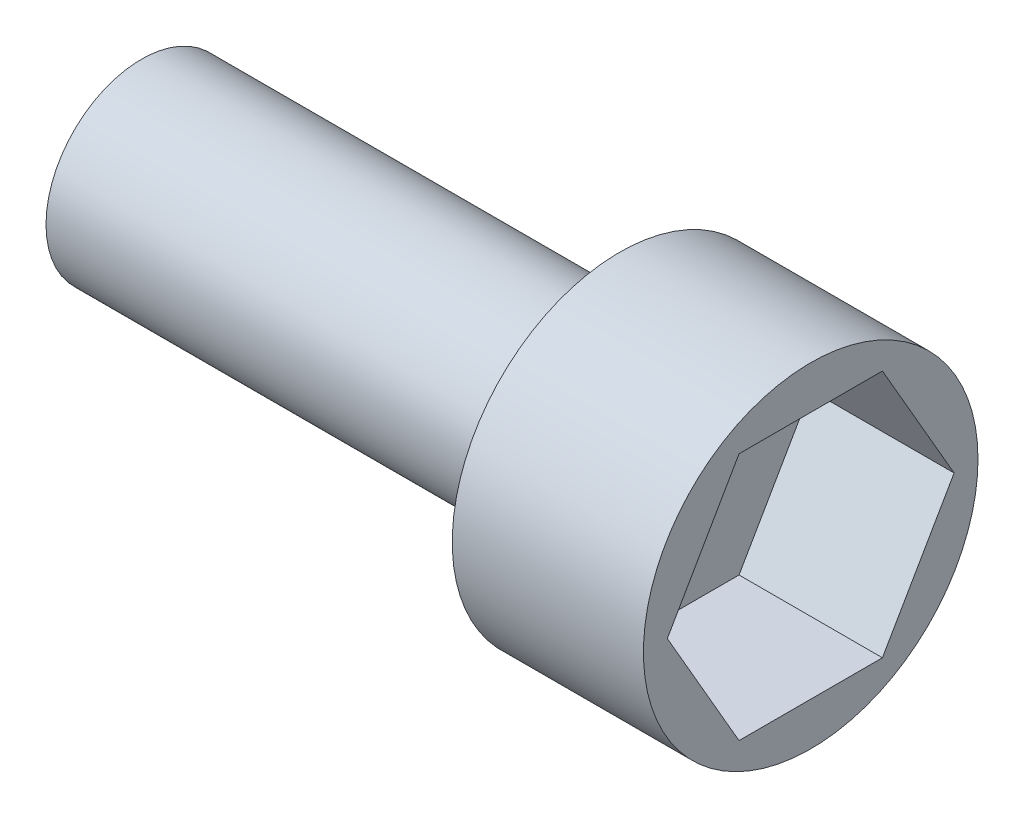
ISO-10303-21;
HEADER;
FILE_DESCRIPTION(('STEP AP214'),'2;1');
FILE_NAME('part.step','',(''),(''),'','','');
FILE_SCHEMA(('AUTOMOTIVE_DESIGN { 1 0 10303 214 1 1 1 1 }'));
ENDSEC;
DATA;
#1=APPLICATION_CONTEXT('core data for automotive mechanical design processes');
#2=APPLICATION_PROTOCOL_DEFINITION('international standard','automotive_design',2000,#1);
#3=PRODUCT_CONTEXT('',#1,'mechanical');
#4=PRODUCT('Part','Part','',(#3));
#5=PRODUCT_RELATED_PRODUCT_CATEGORY('part','',(#4));
#6=PRODUCT_DEFINITION_FORMATION('','',#4);
#7=PRODUCT_DEFINITION_CONTEXT('part definition',#1,'design');
#8=PRODUCT_DEFINITION('design','',#6,#7);
#9=PRODUCT_DEFINITION_SHAPE('','',#8);
#10=(LENGTH_UNIT() NAMED_UNIT(*) SI_UNIT(.MILLI.,.METRE.));
#11=(NAMED_UNIT(*) PLANE_ANGLE_UNIT() SI_UNIT($,.RADIAN.));
#12=(NAMED_UNIT(*) SI_UNIT($,.STERADIAN.) SOLID_ANGLE_UNIT());
#13=UNCERTAINTY_MEASURE_WITH_UNIT(LENGTH_MEASURE(1.E-05),#10,'distance_accuracy_value','');
#14=(GEOMETRIC_REPRESENTATION_CONTEXT(3) GLOBAL_UNCERTAINTY_ASSIGNED_CONTEXT((#13)) GLOBAL_UNIT_ASSIGNED_CONTEXT((#10,
#11,#12)) REPRESENTATION_CONTEXT('',''));
#15=CARTESIAN_POINT('',(0.,0.,0.));
#16=DIRECTION('',(0.,0.,1.));
#17=DIRECTION('',(1.,0.,0.));
#18=AXIS2_PLACEMENT_3D('',#15,#16,#17);
#19=CARTESIAN_POINT('',(10.,0.,0.));
#20=DIRECTION('',(-1.,0.,0.));
#21=DIRECTION('',(0.,0.,1.));
#22=AXIS2_PLACEMENT_3D('',#19,#20,#21);
#23=CYLINDRICAL_SURFACE('',#22,2.);
#24=CARTESIAN_POINT('',(10.,0.,0.));
#25=DIRECTION('',(1.,0.,0.));
#26=DIRECTION('',(0.,0.,-1.));
#27=AXIS2_PLACEMENT_3D('',#24,#25,#26);
#28=CIRCLE('',#27,2.);
#29=CARTESIAN_POINT('',(10.,0.,-2.));
#30=VERTEX_POINT('',#29);
#31=EDGE_CURVE('E11',#30,#30,#28,.T.);
#32=ORIENTED_EDGE('',*,*,#31,.F.);
#33=EDGE_LOOP('',(#32));
#34=FACE_BOUND('',#33,.T.);
#35=CARTESIAN_POINT('',(0.,0.,0.));
#36=DIRECTION('',(1.,0.,0.));
#37=DIRECTION('',(0.,0.,-1.));
#38=AXIS2_PLACEMENT_3D('',#35,#36,#37);
#39=CIRCLE('',#38,2.);
#40=CARTESIAN_POINT('',(0.,0.,-2.));
#41=VERTEX_POINT('',#40);
#42=EDGE_CURVE('E48',#41,#41,#39,.T.);
#43=ORIENTED_EDGE('',*,*,#42,.T.);
#44=EDGE_LOOP('',(#43));
#45=FACE_BOUND('',#44,.T.);
#46=ADVANCED_FACE('F45',(#34,#45),#23,.T.);
#47=CARTESIAN_POINT('',(0.,0.,0.));
#48=DIRECTION('',(1.,0.,0.));
#49=DIRECTION('',(0.,0.,-1.));
#50=AXIS2_PLACEMENT_3D('',#47,#48,#49);
#51=PLANE('',#50);
#52=ORIENTED_EDGE('',*,*,#42,.F.);
#53=EDGE_LOOP('',(#52));
#54=FACE_BOUND('',#53,.T.);
#55=ADVANCED_FACE('F196',(#54),#51,.F.);
#56=CARTESIAN_POINT('',(14.,0.,0.));
#57=DIRECTION('',(-1.,0.,0.));
#58=DIRECTION('',(0.,0.,1.));
#59=AXIS2_PLACEMENT_3D('',#56,#57,#58);
#60=CYLINDRICAL_SURFACE('',#59,3.5);
#61=CARTESIAN_POINT('',(14.,0.,0.));
#62=DIRECTION('',(1.,0.,0.));
#63=DIRECTION('',(0.,0.,-1.));
#64=AXIS2_PLACEMENT_3D('',#61,#62,#63);
#65=CIRCLE('',#64,3.5);
#66=CARTESIAN_POINT('',(14.,0.,-3.5));
#67=VERTEX_POINT('',#66);
#68=EDGE_CURVE('E169',#67,#67,#65,.T.);
#69=ORIENTED_EDGE('',*,*,#68,.F.);
#70=EDGE_LOOP('',(#69));
#71=FACE_BOUND('',#70,.T.);
#72=CARTESIAN_POINT('',(10.,0.,0.));
#73=DIRECTION('',(1.,0.,0.));
#74=DIRECTION('',(0.,0.,-1.));
#75=AXIS2_PLACEMENT_3D('',#72,#73,#74);
#76=CIRCLE('',#75,3.5);
#77=CARTESIAN_POINT('',(10.,0.,-3.5));
#78=VERTEX_POINT('',#77);
#79=EDGE_CURVE('E159',#78,#78,#76,.T.);
#80=ORIENTED_EDGE('',*,*,#79,.T.);
#81=EDGE_LOOP('',(#80));
#82=FACE_BOUND('',#81,.T.);
#83=ADVANCED_FACE('F177',(#71,#82),#60,.T.);
#84=CARTESIAN_POINT('',(14.,0.,0.));
#85=DIRECTION('',(1.,0.,0.));
#86=DIRECTION('',(0.,0.,-1.));
#87=AXIS2_PLACEMENT_3D('',#84,#85,#86);
#88=PLANE('',#87);
#89=DIRECTION('',(0.,-0.866025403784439,0.5));
#90=VECTOR('',#89,1.);
#91=CARTESIAN_POINT('',(14.,2.59807621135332,1.5));
#92=LINE('',#91,#90);
#93=CARTESIAN_POINT('',(14.,2.59807621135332,1.5));
#94=VERTEX_POINT('',#93);
#95=CARTESIAN_POINT('',(14.,0.,3.));
#96=VERTEX_POINT('',#95);
#97=EDGE_CURVE('E60',#94,#96,#92,.T.);
#98=ORIENTED_EDGE('',*,*,#97,.F.);
#99=DIRECTION('',(0.,0.,1.));
#100=VECTOR('',#99,1.);
#101=CARTESIAN_POINT('',(14.,2.59807621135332,-1.5));
#102=LINE('',#101,#100);
#103=CARTESIAN_POINT('',(14.,2.59807621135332,-1.5));
#104=VERTEX_POINT('',#103);
#105=EDGE_CURVE('E153',#104,#94,#102,.T.);
#106=ORIENTED_EDGE('',*,*,#105,.F.);
#107=DIRECTION('',(0.,0.866025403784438,0.5));
#108=VECTOR('',#107,1.);
#109=CARTESIAN_POINT('',(14.,0.,-3.));
#110=LINE('',#109,#108);
#111=CARTESIAN_POINT('',(14.,0.,-3.));
#112=VERTEX_POINT('',#111);
#113=EDGE_CURVE('E150',#112,#104,#110,.T.);
#114=ORIENTED_EDGE('',*,*,#113,.F.);
#115=DIRECTION('',(0.,0.866025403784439,-0.5));
#116=VECTOR('',#115,1.);
#117=CARTESIAN_POINT('',(14.,-2.59807621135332,-1.5));
#118=LINE('',#117,#116);
#119=CARTESIAN_POINT('',(14.,-2.59807621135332,-1.5));
#120=VERTEX_POINT('',#119);
#121=EDGE_CURVE('E108',#120,#112,#118,.T.);
#122=ORIENTED_EDGE('',*,*,#121,.F.);
#123=DIRECTION('',(0.,0.,-1.));
#124=VECTOR('',#123,1.);
#125=CARTESIAN_POINT('',(14.,-2.59807621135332,1.5));
#126=LINE('',#125,#124);
#127=CARTESIAN_POINT('',(14.,-2.59807621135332,1.5));
#128=VERTEX_POINT('',#127);
#129=EDGE_CURVE('E144',#128,#120,#126,.T.);
#130=ORIENTED_EDGE('',*,*,#129,.F.);
#131=DIRECTION('',(0.,-0.866025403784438,-0.5));
#132=VECTOR('',#131,1.);
#133=CARTESIAN_POINT('',(14.,0.,3.));
#134=LINE('',#133,#132);
#135=EDGE_CURVE('E140',#96,#128,#134,.T.);
#136=ORIENTED_EDGE('',*,*,#135,.F.);
#137=EDGE_LOOP('',(#98,#106,#114,#122,#130,#136));
#138=FACE_BOUND('',#137,.T.);
#139=ORIENTED_EDGE('',*,*,#68,.T.);
#140=EDGE_LOOP('',(#139));
#141=FACE_BOUND('',#140,.T.);
#142=ADVANCED_FACE('F182',(#138,#141),#88,.T.);
#143=CARTESIAN_POINT('',(10.,0.,0.));
#144=DIRECTION('',(1.,0.,0.));
#145=DIRECTION('',(0.,0.,-1.));
#146=AXIS2_PLACEMENT_3D('',#143,#144,#145);
#147=PLANE('',#146);
#148=ORIENTED_EDGE('',*,*,#31,.T.);
#149=EDGE_LOOP('',(#148));
#150=FACE_BOUND('',#149,.T.);
#151=ORIENTED_EDGE('',*,*,#79,.F.);
#152=EDGE_LOOP('',(#151));
#153=FACE_BOUND('',#152,.T.);
#154=ADVANCED_FACE('F179',(#150,#153),#147,.F.);
#155=CARTESIAN_POINT('',(11.,2.59807621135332,1.5));
#156=DIRECTION('',(0.,0.5,0.866025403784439));
#157=DIRECTION('',(0.,-0.866025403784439,0.5));
#158=AXIS2_PLACEMENT_3D('',#155,#156,#157);
#159=PLANE('',#158);
#160=ORIENTED_EDGE('',*,*,#97,.T.);
#161=DIRECTION('',(1.,0.,0.));
#162=VECTOR('',#161,1.);
#163=CARTESIAN_POINT('',(11.,0.,3.));
#164=LINE('',#163,#162);
#165=CARTESIAN_POINT('',(11.,0.,3.));
#166=VERTEX_POINT('',#165);
#167=EDGE_CURVE('E90',#166,#96,#164,.T.);
#168=ORIENTED_EDGE('',*,*,#167,.F.);
#169=DIRECTION('',(0.,-0.866025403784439,0.5));
#170=VECTOR('',#169,1.);
#171=CARTESIAN_POINT('',(11.,2.59807621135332,1.5));
#172=LINE('',#171,#170);
#173=CARTESIAN_POINT('',(11.,2.59807621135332,1.5));
#174=VERTEX_POINT('',#173);
#175=EDGE_CURVE('E156',#174,#166,#172,.T.);
#176=ORIENTED_EDGE('',*,*,#175,.F.);
#177=DIRECTION('',(1.,0.,0.));
#178=VECTOR('',#177,1.);
#179=CARTESIAN_POINT('',(11.,2.59807621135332,1.5));
#180=LINE('',#179,#178);
#181=EDGE_CURVE('E68',#174,#94,#180,.T.);
#182=ORIENTED_EDGE('',*,*,#181,.T.);
#183=EDGE_LOOP('',(#160,#168,#176,#182));
#184=FACE_BOUND('',#183,.T.);
#185=ADVANCED_FACE('F181',(#184),#159,.F.);
#186=CARTESIAN_POINT('',(11.,2.59807621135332,-1.5));
#187=DIRECTION('',(0.,1.,0.));
#188=DIRECTION('',(0.,0.,1.));
#189=AXIS2_PLACEMENT_3D('',#186,#187,#188);
#190=PLANE('',#189);
#191=ORIENTED_EDGE('',*,*,#105,.T.);
#192=ORIENTED_EDGE('',*,*,#181,.F.);
#193=DIRECTION('',(0.,0.,1.));
#194=VECTOR('',#193,1.);
#195=CARTESIAN_POINT('',(11.,2.59807621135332,-1.5));
#196=LINE('',#195,#194);
#197=CARTESIAN_POINT('',(11.,2.59807621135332,-1.5));
#198=VERTEX_POINT('',#197);
#199=EDGE_CURVE('E122',#198,#174,#196,.T.);
#200=ORIENTED_EDGE('',*,*,#199,.F.);
#201=DIRECTION('',(1.,0.,0.));
#202=VECTOR('',#201,1.);
#203=CARTESIAN_POINT('',(11.,2.59807621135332,-1.5));
#204=LINE('',#203,#202);
#205=EDGE_CURVE('E113',#198,#104,#204,.T.);
#206=ORIENTED_EDGE('',*,*,#205,.T.);
#207=EDGE_LOOP('',(#191,#192,#200,#206));
#208=FACE_BOUND('',#207,.T.);
#209=ADVANCED_FACE('F190',(#208),#190,.F.);
#210=CARTESIAN_POINT('',(11.,0.,-3.));
#211=DIRECTION('',(0.,0.5,-0.866025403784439));
#212=DIRECTION('',(0.,0.866025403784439,0.5));
#213=AXIS2_PLACEMENT_3D('',#210,#211,#212);
#214=PLANE('',#213);
#215=ORIENTED_EDGE('',*,*,#113,.T.);
#216=ORIENTED_EDGE('',*,*,#205,.F.);
#217=DIRECTION('',(0.,0.866025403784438,0.5));
#218=VECTOR('',#217,1.);
#219=CARTESIAN_POINT('',(11.,0.,-3.));
#220=LINE('',#219,#218);
#221=CARTESIAN_POINT('',(11.,0.,-3.));
#222=VERTEX_POINT('',#221);
#223=EDGE_CURVE('E117',#222,#198,#220,.T.);
#224=ORIENTED_EDGE('',*,*,#223,.F.);
#225=DIRECTION('',(1.,0.,0.));
#226=VECTOR('',#225,1.);
#227=CARTESIAN_POINT('',(11.,0.,-3.));
#228=LINE('',#227,#226);
#229=EDGE_CURVE('E101',#222,#112,#228,.T.);
#230=ORIENTED_EDGE('',*,*,#229,.T.);
#231=EDGE_LOOP('',(#215,#216,#224,#230));
#232=FACE_BOUND('',#231,.T.);
#233=ADVANCED_FACE('F118',(#232),#214,.F.);
#234=CARTESIAN_POINT('',(11.,-2.59807621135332,-1.5));
#235=DIRECTION('',(0.,-0.5,-0.866025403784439));
#236=DIRECTION('',(0.,0.866025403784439,-0.5));
#237=AXIS2_PLACEMENT_3D('',#234,#235,#236);
#238=PLANE('',#237);
#239=ORIENTED_EDGE('',*,*,#121,.T.);
#240=ORIENTED_EDGE('',*,*,#229,.F.);
#241=DIRECTION('',(0.,0.866025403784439,-0.5));
#242=VECTOR('',#241,1.);
#243=CARTESIAN_POINT('',(11.,-2.59807621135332,-1.5));
#244=LINE('',#243,#242);
#245=CARTESIAN_POINT('',(11.,-2.59807621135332,-1.5));
#246=VERTEX_POINT('',#245);
#247=EDGE_CURVE('E105',#246,#222,#244,.T.);
#248=ORIENTED_EDGE('',*,*,#247,.F.);
#249=DIRECTION('',(1.,0.,0.));
#250=VECTOR('',#249,1.);
#251=CARTESIAN_POINT('',(11.,-2.59807621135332,-1.5));
#252=LINE('',#251,#250);
#253=EDGE_CURVE('E114',#246,#120,#252,.T.);
#254=ORIENTED_EDGE('',*,*,#253,.T.);
#255=EDGE_LOOP('',(#239,#240,#248,#254));
#256=FACE_BOUND('',#255,.T.);
#257=ADVANCED_FACE('F103',(#256),#238,.F.);
#258=CARTESIAN_POINT('',(11.,-2.59807621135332,1.5));
#259=DIRECTION('',(0.,-1.,0.));
#260=DIRECTION('',(0.,0.,-1.));
#261=AXIS2_PLACEMENT_3D('',#258,#259,#260);
#262=PLANE('',#261);
#263=ORIENTED_EDGE('',*,*,#129,.T.);
#264=ORIENTED_EDGE('',*,*,#253,.F.);
#265=DIRECTION('',(0.,0.,-1.));
#266=VECTOR('',#265,1.);
#267=CARTESIAN_POINT('',(11.,-2.59807621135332,1.5));
#268=LINE('',#267,#266);
#269=CARTESIAN_POINT('',(11.,-2.59807621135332,1.5));
#270=VERTEX_POINT('',#269);
#271=EDGE_CURVE('E128',#270,#246,#268,.T.);
#272=ORIENTED_EDGE('',*,*,#271,.F.);
#273=DIRECTION('',(1.,0.,0.));
#274=VECTOR('',#273,1.);
#275=CARTESIAN_POINT('',(11.,-2.59807621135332,1.5));
#276=LINE('',#275,#274);
#277=EDGE_CURVE('E164',#270,#128,#276,.T.);
#278=ORIENTED_EDGE('',*,*,#277,.T.);
#279=EDGE_LOOP('',(#263,#264,#272,#278));
#280=FACE_BOUND('',#279,.T.);
#281=ADVANCED_FACE('F259',(#280),#262,.F.);
#282=CARTESIAN_POINT('',(11.,0.,3.));
#283=DIRECTION('',(0.,-0.5,0.866025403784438));
#284=DIRECTION('',(0.,-0.866025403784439,-0.5));
#285=AXIS2_PLACEMENT_3D('',#282,#283,#284);
#286=PLANE('',#285);
#287=ORIENTED_EDGE('',*,*,#135,.T.);
#288=ORIENTED_EDGE('',*,*,#277,.F.);
#289=DIRECTION('',(0.,-0.866025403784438,-0.5));
#290=VECTOR('',#289,1.);
#291=CARTESIAN_POINT('',(11.,0.,3.));
#292=LINE('',#291,#290);
#293=EDGE_CURVE('E132',#166,#270,#292,.T.);
#294=ORIENTED_EDGE('',*,*,#293,.F.);
#295=ORIENTED_EDGE('',*,*,#167,.T.);
#296=EDGE_LOOP('',(#287,#288,#294,#295));
#297=FACE_BOUND('',#296,.T.);
#298=ADVANCED_FACE('F268',(#297),#286,.F.);
#299=CARTESIAN_POINT('',(11.,0.,0.));
#300=DIRECTION('',(1.,0.,0.));
#301=DIRECTION('',(0.,0.,-1.));
#302=AXIS2_PLACEMENT_3D('',#299,#300,#301);
#303=PLANE('',#302);
#304=ORIENTED_EDGE('',*,*,#175,.T.);
#305=ORIENTED_EDGE('',*,*,#293,.T.);
#306=ORIENTED_EDGE('',*,*,#271,.T.);
#307=ORIENTED_EDGE('',*,*,#247,.T.);
#308=ORIENTED_EDGE('',*,*,#223,.T.);
#309=ORIENTED_EDGE('',*,*,#199,.T.);
#310=EDGE_LOOP('',(#304,#305,#306,#307,#308,#309));
#311=FACE_BOUND('',#310,.T.);
#312=ADVANCED_FACE('F125',(#311),#303,.T.);
#313=CLOSED_SHELL('',(#46,#55,#83,#142,#154,#185,#209,#233,#257,#281,#298,#312));
#314=MANIFOLD_SOLID_BREP('B2',#313);
#315=ADVANCED_BREP_SHAPE_REPRESENTATION('',(#18,#314),#14);
#316=SHAPE_DEFINITION_REPRESENTATION(#9,#315);
ENDSEC;
END-ISO-10303-21;
